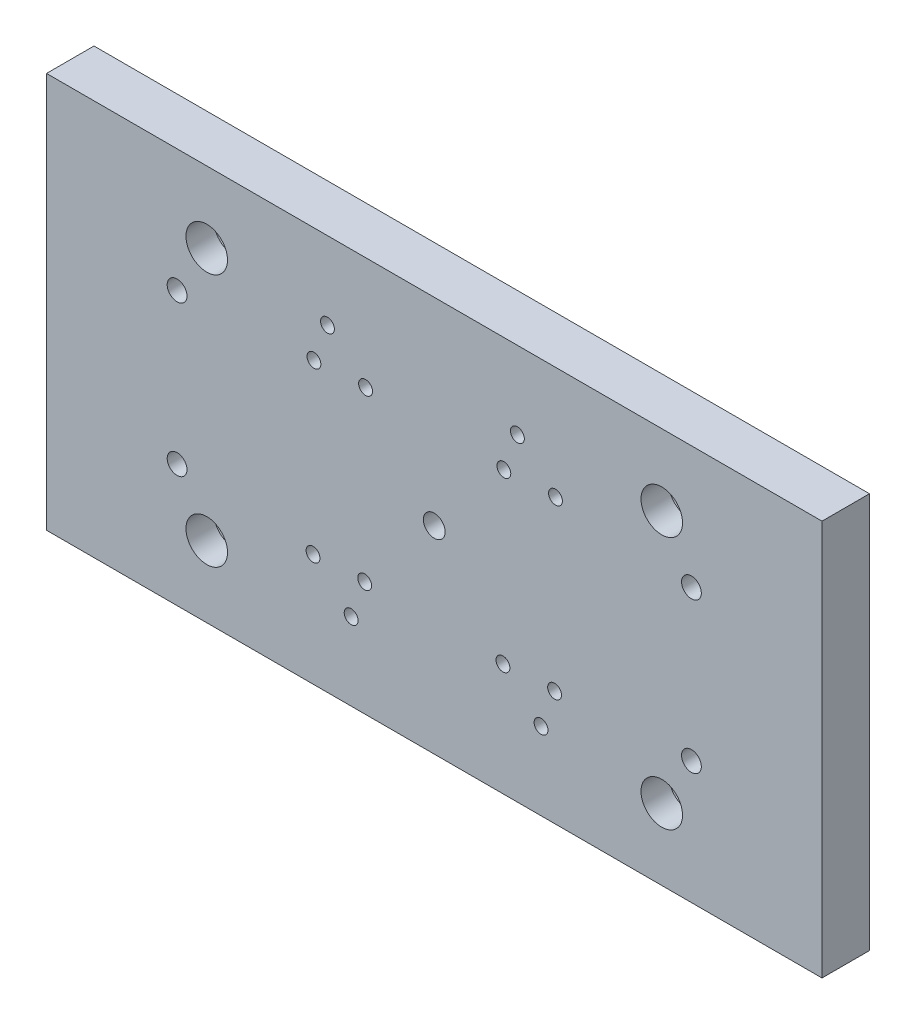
ISO-10303-21;
HEADER;
FILE_DESCRIPTION(('STEP AP214'),'2;1');
FILE_NAME('part.step','',(''),(''),'','','');
FILE_SCHEMA(('AUTOMOTIVE_DESIGN { 1 0 10303 214 1 1 1 1 }'));
ENDSEC;
DATA;
#1=APPLICATION_CONTEXT('core data for automotive mechanical design processes');
#2=APPLICATION_PROTOCOL_DEFINITION('international standard','automotive_design',2000,#1);
#3=PRODUCT_CONTEXT('',#1,'mechanical');
#4=PRODUCT('Part','Part','',(#3));
#5=PRODUCT_RELATED_PRODUCT_CATEGORY('part','',(#4));
#6=PRODUCT_DEFINITION_FORMATION('','',#4);
#7=PRODUCT_DEFINITION_CONTEXT('part definition',#1,'design');
#8=PRODUCT_DEFINITION('design','',#6,#7);
#9=PRODUCT_DEFINITION_SHAPE('','',#8);
#10=(LENGTH_UNIT() NAMED_UNIT(*) SI_UNIT(.MILLI.,.METRE.));
#11=(NAMED_UNIT(*) PLANE_ANGLE_UNIT() SI_UNIT($,.RADIAN.));
#12=(NAMED_UNIT(*) SI_UNIT($,.STERADIAN.) SOLID_ANGLE_UNIT());
#13=UNCERTAINTY_MEASURE_WITH_UNIT(LENGTH_MEASURE(1.E-05),#10,'distance_accuracy_value','');
#14=(GEOMETRIC_REPRESENTATION_CONTEXT(3) GLOBAL_UNCERTAINTY_ASSIGNED_CONTEXT((#13)) GLOBAL_UNIT_ASSIGNED_CONTEXT((#10,
#11,#12)) REPRESENTATION_CONTEXT('',''));
#15=CARTESIAN_POINT('',(0.,0.,0.));
#16=DIRECTION('',(0.,0.,1.));
#17=DIRECTION('',(1.,0.,0.));
#18=AXIS2_PLACEMENT_3D('',#15,#16,#17);
#19=CARTESIAN_POINT('',(40.5,18.,0.));
#20=DIRECTION('',(0.,0.,1.));
#21=DIRECTION('',(1.,0.,0.));
#22=AXIS2_PLACEMENT_3D('',#19,#20,#21);
#23=CYLINDRICAL_SURFACE('',#22,5.25000000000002);
#24=CARTESIAN_POINT('',(40.5,18.,12.));
#25=DIRECTION('',(0.,0.,1.));
#26=DIRECTION('',(1.,0.,0.));
#27=AXIS2_PLACEMENT_3D('',#24,#25,#26);
#28=CIRCLE('',#27,5.25000000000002);
#29=CARTESIAN_POINT('',(45.75,18.,12.));
#30=VERTEX_POINT('',#29);
#31=EDGE_CURVE('E636',#30,#30,#28,.T.);
#32=ORIENTED_EDGE('',*,*,#31,.T.);
#33=EDGE_LOOP('',(#32));
#34=FACE_BOUND('',#33,.T.);
#35=CARTESIAN_POINT('',(40.5,18.,5.));
#36=DIRECTION('',(0.,0.,-1.));
#37=DIRECTION('',(-1.,0.,0.));
#38=AXIS2_PLACEMENT_3D('',#35,#36,#37);
#39=CIRCLE('',#38,5.25000000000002);
#40=CARTESIAN_POINT('',(35.25,18.,5.));
#41=VERTEX_POINT('',#40);
#42=EDGE_CURVE('E520',#41,#41,#39,.F.);
#43=ORIENTED_EDGE('',*,*,#42,.F.);
#44=EDGE_LOOP('',(#43));
#45=FACE_BOUND('',#44,.T.);
#46=ADVANCED_FACE('F366',(#34,#45),#23,.F.);
#47=CARTESIAN_POINT('',(155.5,82.,0.));
#48=DIRECTION('',(0.,0.,1.));
#49=DIRECTION('',(1.,0.,0.));
#50=AXIS2_PLACEMENT_3D('',#47,#48,#49);
#51=CYLINDRICAL_SURFACE('',#50,5.25);
#52=CARTESIAN_POINT('',(155.5,82.,12.));
#53=DIRECTION('',(0.,0.,1.));
#54=DIRECTION('',(1.,0.,0.));
#55=AXIS2_PLACEMENT_3D('',#52,#53,#54);
#56=CIRCLE('',#55,5.25);
#57=CARTESIAN_POINT('',(160.75,82.,12.));
#58=VERTEX_POINT('',#57);
#59=EDGE_CURVE('E426',#58,#58,#56,.T.);
#60=ORIENTED_EDGE('',*,*,#59,.T.);
#61=EDGE_LOOP('',(#60));
#62=FACE_BOUND('',#61,.T.);
#63=CARTESIAN_POINT('',(155.5,82.,5.));
#64=DIRECTION('',(0.,0.,-1.));
#65=DIRECTION('',(-1.,0.,0.));
#66=AXIS2_PLACEMENT_3D('',#63,#64,#65);
#67=CIRCLE('',#66,5.25);
#68=CARTESIAN_POINT('',(150.25,82.,5.));
#69=VERTEX_POINT('',#68);
#70=EDGE_CURVE('E511',#69,#69,#67,.F.);
#71=ORIENTED_EDGE('',*,*,#70,.F.);
#72=EDGE_LOOP('',(#71));
#73=FACE_BOUND('',#72,.T.);
#74=ADVANCED_FACE('F661',(#62,#73),#51,.F.);
#75=CARTESIAN_POINT('',(115.59,71.07,0.));
#76=DIRECTION('',(0.,0.,1.));
#77=DIRECTION('',(1.,0.,0.));
#78=AXIS2_PLACEMENT_3D('',#75,#76,#77);
#79=CYLINDRICAL_SURFACE('',#78,1.75);
#80=CARTESIAN_POINT('',(115.59,71.07,12.));
#81=DIRECTION('',(0.,0.,1.));
#82=DIRECTION('',(1.,0.,0.));
#83=AXIS2_PLACEMENT_3D('',#80,#81,#82);
#84=CIRCLE('',#83,1.75);
#85=CARTESIAN_POINT('',(117.34,71.07,12.));
#86=VERTEX_POINT('',#85);
#87=EDGE_CURVE('E621',#86,#86,#84,.T.);
#88=ORIENTED_EDGE('',*,*,#87,.T.);
#89=EDGE_LOOP('',(#88));
#90=FACE_BOUND('',#89,.T.);
#91=CARTESIAN_POINT('',(115.59,71.07,3.05));
#92=DIRECTION('',(0.,0.,-1.));
#93=DIRECTION('',(-1.,0.,0.));
#94=AXIS2_PLACEMENT_3D('',#91,#92,#93);
#95=CIRCLE('',#94,1.75);
#96=CARTESIAN_POINT('',(113.84,71.07,3.05));
#97=VERTEX_POINT('',#96);
#98=EDGE_CURVE('E506',#97,#97,#95,.F.);
#99=ORIENTED_EDGE('',*,*,#98,.F.);
#100=EDGE_LOOP('',(#99));
#101=FACE_BOUND('',#100,.T.);
#102=ADVANCED_FACE('F668',(#90,#101),#79,.F.);
#103=CARTESIAN_POINT('',(119.01,80.41,0.));
#104=DIRECTION('',(0.,0.,1.));
#105=DIRECTION('',(1.,0.,0.));
#106=AXIS2_PLACEMENT_3D('',#103,#104,#105);
#107=CYLINDRICAL_SURFACE('',#106,1.75);
#108=CARTESIAN_POINT('',(119.01,80.41,12.));
#109=DIRECTION('',(0.,0.,1.));
#110=DIRECTION('',(1.,0.,0.));
#111=AXIS2_PLACEMENT_3D('',#108,#109,#110);
#112=CIRCLE('',#111,1.75);
#113=CARTESIAN_POINT('',(120.76,80.41,12.));
#114=VERTEX_POINT('',#113);
#115=EDGE_CURVE('E627',#114,#114,#112,.T.);
#116=ORIENTED_EDGE('',*,*,#115,.T.);
#117=EDGE_LOOP('',(#116));
#118=FACE_BOUND('',#117,.T.);
#119=CARTESIAN_POINT('',(119.01,80.41,3.05));
#120=DIRECTION('',(0.,0.,-1.));
#121=DIRECTION('',(-1.,0.,0.));
#122=AXIS2_PLACEMENT_3D('',#119,#120,#121);
#123=CIRCLE('',#122,1.75);
#124=CARTESIAN_POINT('',(117.26,80.41,3.05));
#125=VERTEX_POINT('',#124);
#126=EDGE_CURVE('E501',#125,#125,#123,.F.);
#127=ORIENTED_EDGE('',*,*,#126,.F.);
#128=EDGE_LOOP('',(#127));
#129=FACE_BOUND('',#128,.T.);
#130=ADVANCED_FACE('F794',(#118,#129),#107,.F.);
#131=CARTESIAN_POINT('',(128.64,71.58,0.));
#132=DIRECTION('',(0.,0.,1.));
#133=DIRECTION('',(1.,0.,0.));
#134=AXIS2_PLACEMENT_3D('',#131,#132,#133);
#135=CYLINDRICAL_SURFACE('',#134,1.75000000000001);
#136=CARTESIAN_POINT('',(128.64,71.58,12.));
#137=DIRECTION('',(0.,0.,1.));
#138=DIRECTION('',(1.,0.,0.));
#139=AXIS2_PLACEMENT_3D('',#136,#137,#138);
#140=CIRCLE('',#139,1.75000000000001);
#141=CARTESIAN_POINT('',(130.39,71.58,12.));
#142=VERTEX_POINT('',#141);
#143=EDGE_CURVE('E624',#142,#142,#140,.T.);
#144=ORIENTED_EDGE('',*,*,#143,.T.);
#145=EDGE_LOOP('',(#144));
#146=FACE_BOUND('',#145,.T.);
#147=CARTESIAN_POINT('',(128.64,71.58,3.05));
#148=DIRECTION('',(0.,0.,-1.));
#149=DIRECTION('',(-1.,0.,0.));
#150=AXIS2_PLACEMENT_3D('',#147,#148,#149);
#151=CIRCLE('',#150,1.75000000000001);
#152=CARTESIAN_POINT('',(126.89,71.58,3.05));
#153=VERTEX_POINT('',#152);
#154=EDGE_CURVE('E496',#153,#153,#151,.F.);
#155=ORIENTED_EDGE('',*,*,#154,.F.);
#156=EDGE_LOOP('',(#155));
#157=FACE_BOUND('',#156,.T.);
#158=ADVANCED_FACE('F791',(#146,#157),#135,.F.);
#159=CARTESIAN_POINT('',(80.64,71.58,0.));
#160=DIRECTION('',(0.,0.,1.));
#161=DIRECTION('',(1.,0.,0.));
#162=AXIS2_PLACEMENT_3D('',#159,#160,#161);
#163=CYLINDRICAL_SURFACE('',#162,1.75);
#164=CARTESIAN_POINT('',(80.64,71.58,12.));
#165=DIRECTION('',(0.,0.,1.));
#166=DIRECTION('',(1.,0.,0.));
#167=AXIS2_PLACEMENT_3D('',#164,#165,#166);
#168=CIRCLE('',#167,1.75);
#169=CARTESIAN_POINT('',(82.39,71.58,12.));
#170=VERTEX_POINT('',#169);
#171=EDGE_CURVE('E618',#170,#170,#168,.T.);
#172=ORIENTED_EDGE('',*,*,#171,.T.);
#173=EDGE_LOOP('',(#172));
#174=FACE_BOUND('',#173,.T.);
#175=CARTESIAN_POINT('',(80.64,71.58,3.05));
#176=DIRECTION('',(0.,0.,-1.));
#177=DIRECTION('',(-1.,0.,0.));
#178=AXIS2_PLACEMENT_3D('',#175,#176,#177);
#179=CIRCLE('',#178,1.75);
#180=CARTESIAN_POINT('',(78.89,71.58,3.05));
#181=VERTEX_POINT('',#180);
#182=EDGE_CURVE('E491',#181,#181,#179,.F.);
#183=ORIENTED_EDGE('',*,*,#182,.F.);
#184=EDGE_LOOP('',(#183));
#185=FACE_BOUND('',#184,.T.);
#186=ADVANCED_FACE('F787',(#174,#185),#163,.F.);
#187=CARTESIAN_POINT('',(71.01,80.41,0.));
#188=DIRECTION('',(0.,0.,1.));
#189=DIRECTION('',(1.,0.,0.));
#190=AXIS2_PLACEMENT_3D('',#187,#188,#189);
#191=CYLINDRICAL_SURFACE('',#190,1.75);
#192=CARTESIAN_POINT('',(71.01,80.41,12.));
#193=DIRECTION('',(0.,0.,1.));
#194=DIRECTION('',(1.,0.,0.));
#195=AXIS2_PLACEMENT_3D('',#192,#193,#194);
#196=CIRCLE('',#195,1.75);
#197=CARTESIAN_POINT('',(72.76,80.41,12.));
#198=VERTEX_POINT('',#197);
#199=EDGE_CURVE('E615',#198,#198,#196,.T.);
#200=ORIENTED_EDGE('',*,*,#199,.T.);
#201=EDGE_LOOP('',(#200));
#202=FACE_BOUND('',#201,.T.);
#203=CARTESIAN_POINT('',(71.01,80.41,3.05));
#204=DIRECTION('',(0.,0.,-1.));
#205=DIRECTION('',(-1.,0.,0.));
#206=AXIS2_PLACEMENT_3D('',#203,#204,#205);
#207=CIRCLE('',#206,1.75);
#208=CARTESIAN_POINT('',(69.26,80.41,3.05));
#209=VERTEX_POINT('',#208);
#210=EDGE_CURVE('E486',#209,#209,#207,.F.);
#211=ORIENTED_EDGE('',*,*,#210,.F.);
#212=EDGE_LOOP('',(#211));
#213=FACE_BOUND('',#212,.T.);
#214=ADVANCED_FACE('F783',(#202,#213),#191,.F.);
#215=CARTESIAN_POINT('',(67.59,71.01,0.));
#216=DIRECTION('',(0.,0.,1.));
#217=DIRECTION('',(1.,0.,0.));
#218=AXIS2_PLACEMENT_3D('',#215,#216,#217);
#219=CYLINDRICAL_SURFACE('',#218,1.75);
#220=CARTESIAN_POINT('',(67.59,71.01,12.));
#221=DIRECTION('',(0.,0.,1.));
#222=DIRECTION('',(1.,0.,0.));
#223=AXIS2_PLACEMENT_3D('',#220,#221,#222);
#224=CIRCLE('',#223,1.75);
#225=CARTESIAN_POINT('',(69.34,71.01,12.));
#226=VERTEX_POINT('',#225);
#227=EDGE_CURVE('E612',#226,#226,#224,.T.);
#228=ORIENTED_EDGE('',*,*,#227,.T.);
#229=EDGE_LOOP('',(#228));
#230=FACE_BOUND('',#229,.T.);
#231=CARTESIAN_POINT('',(67.59,71.01,3.05));
#232=DIRECTION('',(0.,0.,-1.));
#233=DIRECTION('',(-1.,0.,0.));
#234=AXIS2_PLACEMENT_3D('',#231,#232,#233);
#235=CIRCLE('',#234,1.75);
#236=CARTESIAN_POINT('',(65.84,71.01,3.05));
#237=VERTEX_POINT('',#236);
#238=EDGE_CURVE('E481',#237,#237,#235,.F.);
#239=ORIENTED_EDGE('',*,*,#238,.F.);
#240=EDGE_LOOP('',(#239));
#241=FACE_BOUND('',#240,.T.);
#242=ADVANCED_FACE('F776',(#230,#241),#219,.F.);
#243=CARTESIAN_POINT('',(67.36,28.42,0.));
#244=DIRECTION('',(0.,0.,1.));
#245=DIRECTION('',(1.,0.,0.));
#246=AXIS2_PLACEMENT_3D('',#243,#244,#245);
#247=CYLINDRICAL_SURFACE('',#246,1.75000000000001);
#248=CARTESIAN_POINT('',(67.36,28.42,12.));
#249=DIRECTION('',(0.,0.,1.));
#250=DIRECTION('',(1.,0.,0.));
#251=AXIS2_PLACEMENT_3D('',#248,#249,#250);
#252=CIRCLE('',#251,1.75000000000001);
#253=CARTESIAN_POINT('',(69.11,28.42,12.));
#254=VERTEX_POINT('',#253);
#255=EDGE_CURVE('E606',#254,#254,#252,.T.);
#256=ORIENTED_EDGE('',*,*,#255,.T.);
#257=EDGE_LOOP('',(#256));
#258=FACE_BOUND('',#257,.T.);
#259=CARTESIAN_POINT('',(67.36,28.42,3.05));
#260=DIRECTION('',(0.,0.,-1.));
#261=DIRECTION('',(-1.,0.,0.));
#262=AXIS2_PLACEMENT_3D('',#259,#260,#261);
#263=CIRCLE('',#262,1.75000000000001);
#264=CARTESIAN_POINT('',(65.61,28.42,3.05));
#265=VERTEX_POINT('',#264);
#266=EDGE_CURVE('E476',#265,#265,#263,.F.);
#267=ORIENTED_EDGE('',*,*,#266,.F.);
#268=EDGE_LOOP('',(#267));
#269=FACE_BOUND('',#268,.T.);
#270=ADVANCED_FACE('F773',(#258,#269),#247,.F.);
#271=CARTESIAN_POINT('',(76.99,19.59,0.));
#272=DIRECTION('',(0.,0.,1.));
#273=DIRECTION('',(1.,0.,0.));
#274=AXIS2_PLACEMENT_3D('',#271,#272,#273);
#275=CYLINDRICAL_SURFACE('',#274,1.75);
#276=CARTESIAN_POINT('',(76.99,19.59,12.));
#277=DIRECTION('',(0.,0.,1.));
#278=DIRECTION('',(1.,0.,0.));
#279=AXIS2_PLACEMENT_3D('',#276,#277,#278);
#280=CIRCLE('',#279,1.75);
#281=CARTESIAN_POINT('',(78.74,19.59,12.));
#282=VERTEX_POINT('',#281);
#283=EDGE_CURVE('E609',#282,#282,#280,.T.);
#284=ORIENTED_EDGE('',*,*,#283,.T.);
#285=EDGE_LOOP('',(#284));
#286=FACE_BOUND('',#285,.T.);
#287=CARTESIAN_POINT('',(76.99,19.59,3.05));
#288=DIRECTION('',(0.,0.,-1.));
#289=DIRECTION('',(-1.,0.,0.));
#290=AXIS2_PLACEMENT_3D('',#287,#288,#289);
#291=CIRCLE('',#290,1.75);
#292=CARTESIAN_POINT('',(75.24,19.59,3.05));
#293=VERTEX_POINT('',#292);
#294=EDGE_CURVE('E471',#293,#293,#291,.F.);
#295=ORIENTED_EDGE('',*,*,#294,.F.);
#296=EDGE_LOOP('',(#295));
#297=FACE_BOUND('',#296,.T.);
#298=ADVANCED_FACE('F771',(#286,#297),#275,.F.);
#299=CARTESIAN_POINT('',(80.41,28.93,0.));
#300=DIRECTION('',(0.,0.,1.));
#301=DIRECTION('',(1.,0.,0.));
#302=AXIS2_PLACEMENT_3D('',#299,#300,#301);
#303=CYLINDRICAL_SURFACE('',#302,1.75);
#304=CARTESIAN_POINT('',(80.41,28.93,12.));
#305=DIRECTION('',(0.,0.,1.));
#306=DIRECTION('',(1.,0.,0.));
#307=AXIS2_PLACEMENT_3D('',#304,#305,#306);
#308=CIRCLE('',#307,1.75);
#309=CARTESIAN_POINT('',(82.16,28.93,12.));
#310=VERTEX_POINT('',#309);
#311=EDGE_CURVE('E603',#310,#310,#308,.T.);
#312=ORIENTED_EDGE('',*,*,#311,.T.);
#313=EDGE_LOOP('',(#312));
#314=FACE_BOUND('',#313,.T.);
#315=CARTESIAN_POINT('',(80.41,28.93,3.05));
#316=DIRECTION('',(0.,0.,-1.));
#317=DIRECTION('',(-1.,0.,0.));
#318=AXIS2_PLACEMENT_3D('',#315,#316,#317);
#319=CIRCLE('',#318,1.75);
#320=CARTESIAN_POINT('',(78.66,28.93,3.05));
#321=VERTEX_POINT('',#320);
#322=EDGE_CURVE('E466',#321,#321,#319,.F.);
#323=ORIENTED_EDGE('',*,*,#322,.F.);
#324=EDGE_LOOP('',(#323));
#325=FACE_BOUND('',#324,.T.);
#326=ADVANCED_FACE('F759',(#314,#325),#303,.F.);
#327=CARTESIAN_POINT('',(115.36,28.42,0.));
#328=DIRECTION('',(0.,0.,1.));
#329=DIRECTION('',(1.,0.,0.));
#330=AXIS2_PLACEMENT_3D('',#327,#328,#329);
#331=CYLINDRICAL_SURFACE('',#330,1.75);
#332=CARTESIAN_POINT('',(115.36,28.42,12.));
#333=DIRECTION('',(0.,0.,1.));
#334=DIRECTION('',(1.,0.,0.));
#335=AXIS2_PLACEMENT_3D('',#332,#333,#334);
#336=CIRCLE('',#335,1.75);
#337=CARTESIAN_POINT('',(117.11,28.42,12.));
#338=VERTEX_POINT('',#337);
#339=EDGE_CURVE('E449',#338,#338,#336,.T.);
#340=ORIENTED_EDGE('',*,*,#339,.T.);
#341=EDGE_LOOP('',(#340));
#342=FACE_BOUND('',#341,.T.);
#343=CARTESIAN_POINT('',(115.36,28.42,3.05));
#344=DIRECTION('',(0.,0.,-1.));
#345=DIRECTION('',(-1.,0.,0.));
#346=AXIS2_PLACEMENT_3D('',#343,#344,#345);
#347=CIRCLE('',#346,1.75);
#348=CARTESIAN_POINT('',(113.61,28.42,3.05));
#349=VERTEX_POINT('',#348);
#350=EDGE_CURVE('E461',#349,#349,#347,.F.);
#351=ORIENTED_EDGE('',*,*,#350,.F.);
#352=EDGE_LOOP('',(#351));
#353=FACE_BOUND('',#352,.T.);
#354=ADVANCED_FACE('F755',(#342,#353),#331,.F.);
#355=CARTESIAN_POINT('',(128.41,28.99,0.));
#356=DIRECTION('',(0.,0.,1.));
#357=DIRECTION('',(1.,0.,0.));
#358=AXIS2_PLACEMENT_3D('',#355,#356,#357);
#359=CYLINDRICAL_SURFACE('',#358,1.75000000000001);
#360=CARTESIAN_POINT('',(128.41,28.99,12.));
#361=DIRECTION('',(0.,0.,1.));
#362=DIRECTION('',(1.,0.,0.));
#363=AXIS2_PLACEMENT_3D('',#360,#361,#362);
#364=CIRCLE('',#363,1.75000000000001);
#365=CARTESIAN_POINT('',(130.16,28.99,12.));
#366=VERTEX_POINT('',#365);
#367=EDGE_CURVE('E597',#366,#366,#364,.T.);
#368=ORIENTED_EDGE('',*,*,#367,.T.);
#369=EDGE_LOOP('',(#368));
#370=FACE_BOUND('',#369,.T.);
#371=CARTESIAN_POINT('',(128.41,28.99,3.05));
#372=DIRECTION('',(0.,0.,-1.));
#373=DIRECTION('',(-1.,0.,0.));
#374=AXIS2_PLACEMENT_3D('',#371,#372,#373);
#375=CIRCLE('',#374,1.75000000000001);
#376=CARTESIAN_POINT('',(126.66,28.99,3.05));
#377=VERTEX_POINT('',#376);
#378=EDGE_CURVE('E456',#377,#377,#375,.F.);
#379=ORIENTED_EDGE('',*,*,#378,.F.);
#380=EDGE_LOOP('',(#379));
#381=FACE_BOUND('',#380,.T.);
#382=ADVANCED_FACE('F758',(#370,#381),#359,.F.);
#383=CARTESIAN_POINT('',(124.99,19.59,0.));
#384=DIRECTION('',(0.,0.,1.));
#385=DIRECTION('',(1.,0.,0.));
#386=AXIS2_PLACEMENT_3D('',#383,#384,#385);
#387=CYLINDRICAL_SURFACE('',#386,1.75);
#388=CARTESIAN_POINT('',(124.99,19.59,12.));
#389=DIRECTION('',(0.,0.,1.));
#390=DIRECTION('',(1.,0.,0.));
#391=AXIS2_PLACEMENT_3D('',#388,#389,#390);
#392=CIRCLE('',#391,1.75);
#393=CARTESIAN_POINT('',(126.74,19.59,12.));
#394=VERTEX_POINT('',#393);
#395=EDGE_CURVE('E600',#394,#394,#392,.T.);
#396=ORIENTED_EDGE('',*,*,#395,.T.);
#397=EDGE_LOOP('',(#396));
#398=FACE_BOUND('',#397,.T.);
#399=CARTESIAN_POINT('',(124.99,19.59,3.05));
#400=DIRECTION('',(0.,0.,-1.));
#401=DIRECTION('',(-1.,0.,0.));
#402=AXIS2_PLACEMENT_3D('',#399,#400,#401);
#403=CIRCLE('',#402,1.75);
#404=CARTESIAN_POINT('',(123.24,19.59,3.05));
#405=VERTEX_POINT('',#404);
#406=EDGE_CURVE('E451',#405,#405,#403,.F.);
#407=ORIENTED_EDGE('',*,*,#406,.F.);
#408=EDGE_LOOP('',(#407));
#409=FACE_BOUND('',#408,.T.);
#410=ADVANCED_FACE('F763',(#398,#409),#387,.F.);
#411=CARTESIAN_POINT('',(98.,50.,0.));
#412=DIRECTION('',(0.,0.,1.));
#413=DIRECTION('',(1.,0.,0.));
#414=AXIS2_PLACEMENT_3D('',#411,#412,#413);
#415=CYLINDRICAL_SURFACE('',#414,2.75000000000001);
#416=CARTESIAN_POINT('',(98.,50.,12.));
#417=DIRECTION('',(0.,0.,1.));
#418=DIRECTION('',(1.,0.,0.));
#419=AXIS2_PLACEMENT_3D('',#416,#417,#418);
#420=CIRCLE('',#419,2.75000000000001);
#421=CARTESIAN_POINT('',(100.75,50.,12.));
#422=VERTEX_POINT('',#421);
#423=EDGE_CURVE('E630',#422,#422,#420,.T.);
#424=ORIENTED_EDGE('',*,*,#423,.T.);
#425=EDGE_LOOP('',(#424));
#426=FACE_BOUND('',#425,.T.);
#427=CARTESIAN_POINT('',(98.,50.,3.05));
#428=DIRECTION('',(0.,0.,-1.));
#429=DIRECTION('',(-1.,0.,0.));
#430=AXIS2_PLACEMENT_3D('',#427,#428,#429);
#431=CIRCLE('',#430,2.75000000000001);
#432=CARTESIAN_POINT('',(95.25,50.,3.05));
#433=VERTEX_POINT('',#432);
#434=EDGE_CURVE('E446',#433,#433,#431,.F.);
#435=ORIENTED_EDGE('',*,*,#434,.F.);
#436=EDGE_LOOP('',(#435));
#437=FACE_BOUND('',#436,.T.);
#438=ADVANCED_FACE('F767',(#426,#437),#415,.F.);
#439=CARTESIAN_POINT('',(0.,0.,12.));
#440=DIRECTION('',(1.,0.,0.));
#441=DIRECTION('',(0.,1.,0.));
#442=AXIS2_PLACEMENT_3D('',#439,#440,#441);
#443=PLANE('',#442);
#444=DIRECTION('',(0.,-1.,0.));
#445=VECTOR('',#444,1.);
#446=CARTESIAN_POINT('',(0.,0.,0.));
#447=LINE('',#446,#445);
#448=CARTESIAN_POINT('',(0.,100.,0.));
#449=VERTEX_POINT('',#448);
#450=CARTESIAN_POINT('',(0.,0.,0.));
#451=VERTEX_POINT('',#450);
#452=EDGE_CURVE('E413',#449,#451,#447,.T.);
#453=ORIENTED_EDGE('',*,*,#452,.T.);
#454=DIRECTION('',(0.,0.,-1.));
#455=VECTOR('',#454,1.);
#456=CARTESIAN_POINT('',(0.,0.,12.));
#457=LINE('',#456,#455);
#458=CARTESIAN_POINT('',(0.,0.,12.));
#459=VERTEX_POINT('',#458);
#460=EDGE_CURVE('E11',#459,#451,#457,.T.);
#461=ORIENTED_EDGE('',*,*,#460,.F.);
#462=DIRECTION('',(0.,-1.,0.));
#463=VECTOR('',#462,1.);
#464=CARTESIAN_POINT('',(0.,0.,12.));
#465=LINE('',#464,#463);
#466=CARTESIAN_POINT('',(0.,100.,12.));
#467=VERTEX_POINT('',#466);
#468=EDGE_CURVE('E436',#467,#459,#465,.T.);
#469=ORIENTED_EDGE('',*,*,#468,.F.);
#470=DIRECTION('',(0.,0.,-1.));
#471=VECTOR('',#470,1.);
#472=CARTESIAN_POINT('',(0.,100.,12.));
#473=LINE('',#472,#471);
#474=EDGE_CURVE('E425',#467,#449,#473,.T.);
#475=ORIENTED_EDGE('',*,*,#474,.T.);
#476=EDGE_LOOP('',(#453,#461,#469,#475));
#477=FACE_BOUND('',#476,.T.);
#478=ADVANCED_FACE('F368',(#477),#443,.F.);
#479=CARTESIAN_POINT('',(0.,0.,12.));
#480=DIRECTION('',(0.,1.,0.));
#481=DIRECTION('',(0.,0.,1.));
#482=AXIS2_PLACEMENT_3D('',#479,#480,#481);
#483=PLANE('',#482);
#484=DIRECTION('',(1.,0.,0.));
#485=VECTOR('',#484,1.);
#486=CARTESIAN_POINT('',(0.,0.,0.));
#487=LINE('',#486,#485);
#488=CARTESIAN_POINT('',(196.,0.,0.));
#489=VERTEX_POINT('',#488);
#490=EDGE_CURVE('E409',#451,#489,#487,.T.);
#491=ORIENTED_EDGE('',*,*,#490,.T.);
#492=DIRECTION('',(0.,0.,-1.));
#493=VECTOR('',#492,1.);
#494=CARTESIAN_POINT('',(196.,0.,12.));
#495=LINE('',#494,#493);
#496=CARTESIAN_POINT('',(196.,0.,12.));
#497=VERTEX_POINT('',#496);
#498=EDGE_CURVE('E375',#497,#489,#495,.T.);
#499=ORIENTED_EDGE('',*,*,#498,.F.);
#500=DIRECTION('',(1.,0.,0.));
#501=VECTOR('',#500,1.);
#502=CARTESIAN_POINT('',(0.,0.,12.));
#503=LINE('',#502,#501);
#504=EDGE_CURVE('E421',#459,#497,#503,.T.);
#505=ORIENTED_EDGE('',*,*,#504,.F.);
#506=ORIENTED_EDGE('',*,*,#460,.T.);
#507=EDGE_LOOP('',(#491,#499,#505,#506));
#508=FACE_BOUND('',#507,.T.);
#509=ADVANCED_FACE('F420',(#508),#483,.F.);
#510=CARTESIAN_POINT('',(196.,0.,12.));
#511=DIRECTION('',(-1.,0.,0.));
#512=DIRECTION('',(0.,-1.,0.));
#513=AXIS2_PLACEMENT_3D('',#510,#511,#512);
#514=PLANE('',#513);
#515=DIRECTION('',(0.,1.,0.));
#516=VECTOR('',#515,1.);
#517=CARTESIAN_POINT('',(196.,0.,0.));
#518=LINE('',#517,#516);
#519=CARTESIAN_POINT('',(196.,100.,0.));
#520=VERTEX_POINT('',#519);
#521=EDGE_CURVE('E414',#489,#520,#518,.T.);
#522=ORIENTED_EDGE('',*,*,#521,.T.);
#523=DIRECTION('',(0.,0.,-1.));
#524=VECTOR('',#523,1.);
#525=CARTESIAN_POINT('',(196.,100.,12.));
#526=LINE('',#525,#524);
#527=CARTESIAN_POINT('',(196.,100.,12.));
#528=VERTEX_POINT('',#527);
#529=EDGE_CURVE('E442',#528,#520,#526,.T.);
#530=ORIENTED_EDGE('',*,*,#529,.F.);
#531=DIRECTION('',(0.,1.,0.));
#532=VECTOR('',#531,1.);
#533=CARTESIAN_POINT('',(196.,0.,12.));
#534=LINE('',#533,#532);
#535=EDGE_CURVE('E388',#497,#528,#534,.T.);
#536=ORIENTED_EDGE('',*,*,#535,.F.);
#537=ORIENTED_EDGE('',*,*,#498,.T.);
#538=EDGE_LOOP('',(#522,#530,#536,#537));
#539=FACE_BOUND('',#538,.T.);
#540=ADVANCED_FACE('F651',(#539),#514,.F.);
#541=CARTESIAN_POINT('',(0.,100.,12.));
#542=DIRECTION('',(0.,-1.,0.));
#543=DIRECTION('',(0.,0.,-1.));
#544=AXIS2_PLACEMENT_3D('',#541,#542,#543);
#545=PLANE('',#544);
#546=DIRECTION('',(-1.,0.,0.));
#547=VECTOR('',#546,1.);
#548=CARTESIAN_POINT('',(0.,100.,0.));
#549=LINE('',#548,#547);
#550=EDGE_CURVE('E434',#520,#449,#549,.T.);
#551=ORIENTED_EDGE('',*,*,#550,.T.);
#552=ORIENTED_EDGE('',*,*,#474,.F.);
#553=DIRECTION('',(-1.,0.,0.));
#554=VECTOR('',#553,1.);
#555=CARTESIAN_POINT('',(0.,100.,12.));
#556=LINE('',#555,#554);
#557=EDGE_CURVE('E383',#528,#467,#556,.T.);
#558=ORIENTED_EDGE('',*,*,#557,.F.);
#559=ORIENTED_EDGE('',*,*,#529,.T.);
#560=EDGE_LOOP('',(#551,#552,#558,#559));
#561=FACE_BOUND('',#560,.T.);
#562=ADVANCED_FACE('F646',(#561),#545,.F.);
#563=CARTESIAN_POINT('',(0.,100.,12.));
#564=DIRECTION('',(0.,0.,-1.));
#565=DIRECTION('',(-1.,0.,0.));
#566=AXIS2_PLACEMENT_3D('',#563,#564,#565);
#567=PLANE('',#566);
#568=CARTESIAN_POINT('',(33.,69.,12.));
#569=DIRECTION('',(0.,0.,-1.));
#570=DIRECTION('',(-1.,0.,0.));
#571=AXIS2_PLACEMENT_3D('',#568,#569,#570);
#572=CIRCLE('',#571,2.5);
#573=CARTESIAN_POINT('',(30.5,69.,12.));
#574=VERTEX_POINT('',#573);
#575=EDGE_CURVE('E842',#574,#574,#572,.T.);
#576=ORIENTED_EDGE('',*,*,#575,.T.);
#577=EDGE_LOOP('',(#576));
#578=FACE_BOUND('',#577,.T.);
#579=CARTESIAN_POINT('',(163.,69.,12.));
#580=DIRECTION('',(0.,0.,-1.));
#581=DIRECTION('',(-1.,0.,0.));
#582=AXIS2_PLACEMENT_3D('',#579,#580,#581);
#583=CIRCLE('',#582,2.5);
#584=CARTESIAN_POINT('',(160.5,69.,12.));
#585=VERTEX_POINT('',#584);
#586=EDGE_CURVE('E838',#585,#585,#583,.T.);
#587=ORIENTED_EDGE('',*,*,#586,.T.);
#588=EDGE_LOOP('',(#587));
#589=FACE_BOUND('',#588,.T.);
#590=CARTESIAN_POINT('',(163.,31.,12.));
#591=DIRECTION('',(0.,0.,-1.));
#592=DIRECTION('',(-1.,0.,0.));
#593=AXIS2_PLACEMENT_3D('',#590,#591,#592);
#594=CIRCLE('',#593,2.5);
#595=CARTESIAN_POINT('',(160.5,31.,12.));
#596=VERTEX_POINT('',#595);
#597=EDGE_CURVE('E834',#596,#596,#594,.T.);
#598=ORIENTED_EDGE('',*,*,#597,.T.);
#599=EDGE_LOOP('',(#598));
#600=FACE_BOUND('',#599,.T.);
#601=CARTESIAN_POINT('',(33.,31.,12.));
#602=DIRECTION('',(0.,0.,-1.));
#603=DIRECTION('',(-1.,0.,0.));
#604=AXIS2_PLACEMENT_3D('',#601,#602,#603);
#605=CIRCLE('',#604,2.5);
#606=CARTESIAN_POINT('',(30.5,31.,12.));
#607=VERTEX_POINT('',#606);
#608=EDGE_CURVE('E830',#607,#607,#605,.T.);
#609=ORIENTED_EDGE('',*,*,#608,.T.);
#610=EDGE_LOOP('',(#609));
#611=FACE_BOUND('',#610,.T.);
#612=ORIENTED_EDGE('',*,*,#339,.F.);
#613=EDGE_LOOP('',(#612));
#614=FACE_BOUND('',#613,.T.);
#615=ORIENTED_EDGE('',*,*,#367,.F.);
#616=EDGE_LOOP('',(#615));
#617=FACE_BOUND('',#616,.T.);
#618=ORIENTED_EDGE('',*,*,#395,.F.);
#619=EDGE_LOOP('',(#618));
#620=FACE_BOUND('',#619,.T.);
#621=ORIENTED_EDGE('',*,*,#311,.F.);
#622=EDGE_LOOP('',(#621));
#623=FACE_BOUND('',#622,.T.);
#624=ORIENTED_EDGE('',*,*,#255,.F.);
#625=EDGE_LOOP('',(#624));
#626=FACE_BOUND('',#625,.T.);
#627=ORIENTED_EDGE('',*,*,#283,.F.);
#628=EDGE_LOOP('',(#627));
#629=FACE_BOUND('',#628,.T.);
#630=ORIENTED_EDGE('',*,*,#227,.F.);
#631=EDGE_LOOP('',(#630));
#632=FACE_BOUND('',#631,.T.);
#633=ORIENTED_EDGE('',*,*,#199,.F.);
#634=EDGE_LOOP('',(#633));
#635=FACE_BOUND('',#634,.T.);
#636=ORIENTED_EDGE('',*,*,#171,.F.);
#637=EDGE_LOOP('',(#636));
#638=FACE_BOUND('',#637,.T.);
#639=ORIENTED_EDGE('',*,*,#87,.F.);
#640=EDGE_LOOP('',(#639));
#641=FACE_BOUND('',#640,.T.);
#642=ORIENTED_EDGE('',*,*,#143,.F.);
#643=EDGE_LOOP('',(#642));
#644=FACE_BOUND('',#643,.T.);
#645=ORIENTED_EDGE('',*,*,#115,.F.);
#646=EDGE_LOOP('',(#645));
#647=FACE_BOUND('',#646,.T.);
#648=ORIENTED_EDGE('',*,*,#423,.F.);
#649=EDGE_LOOP('',(#648));
#650=FACE_BOUND('',#649,.T.);
#651=CARTESIAN_POINT('',(155.5,18.,12.));
#652=DIRECTION('',(0.,0.,1.));
#653=DIRECTION('',(-1.,0.,0.));
#654=AXIS2_PLACEMENT_3D('',#651,#652,#653);
#655=CIRCLE('',#654,5.25);
#656=CARTESIAN_POINT('',(150.25,18.,12.));
#657=VERTEX_POINT('',#656);
#658=EDGE_CURVE('E633',#657,#657,#655,.T.);
#659=ORIENTED_EDGE('',*,*,#658,.F.);
#660=EDGE_LOOP('',(#659));
#661=FACE_BOUND('',#660,.T.);
#662=ORIENTED_EDGE('',*,*,#31,.F.);
#663=EDGE_LOOP('',(#662));
#664=FACE_BOUND('',#663,.T.);
#665=CARTESIAN_POINT('',(40.5,82.,12.));
#666=DIRECTION('',(0.,0.,1.));
#667=DIRECTION('',(-1.,0.,0.));
#668=AXIS2_PLACEMENT_3D('',#665,#666,#667);
#669=CIRCLE('',#668,5.25000000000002);
#670=CARTESIAN_POINT('',(35.25,82.,12.));
#671=VERTEX_POINT('',#670);
#672=EDGE_CURVE('E429',#671,#671,#669,.T.);
#673=ORIENTED_EDGE('',*,*,#672,.F.);
#674=EDGE_LOOP('',(#673));
#675=FACE_BOUND('',#674,.T.);
#676=ORIENTED_EDGE('',*,*,#59,.F.);
#677=EDGE_LOOP('',(#676));
#678=FACE_BOUND('',#677,.T.);
#679=ORIENTED_EDGE('',*,*,#468,.T.);
#680=ORIENTED_EDGE('',*,*,#504,.T.);
#681=ORIENTED_EDGE('',*,*,#535,.T.);
#682=ORIENTED_EDGE('',*,*,#557,.T.);
#683=EDGE_LOOP('',(#679,#680,#681,#682));
#684=FACE_BOUND('',#683,.T.);
#685=ADVANCED_FACE('F643',(#578,#589,#600,#611,#614,#617,#620,#623,#626,#629,#632,#635,#638,
#641,#644,#647,#650,#661,#664,#675,#678,#684),#567,.F.);
#686=CARTESIAN_POINT('',(0.,100.,0.));
#687=DIRECTION('',(0.,0.,-1.));
#688=DIRECTION('',(-1.,0.,0.));
#689=AXIS2_PLACEMENT_3D('',#686,#687,#688);
#690=PLANE('',#689);
#691=CARTESIAN_POINT('',(33.,69.,0.));
#692=DIRECTION('',(0.,0.,-1.));
#693=DIRECTION('',(-1.,0.,0.));
#694=AXIS2_PLACEMENT_3D('',#691,#692,#693);
#695=CIRCLE('',#694,2.49999999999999);
#696=CARTESIAN_POINT('',(30.5,69.,0.));
#697=VERTEX_POINT('',#696);
#698=EDGE_CURVE('E687',#697,#697,#695,.T.);
#699=ORIENTED_EDGE('',*,*,#698,.F.);
#700=EDGE_LOOP('',(#699));
#701=FACE_BOUND('',#700,.T.);
#702=CARTESIAN_POINT('',(163.,69.,0.));
#703=DIRECTION('',(0.,0.,-1.));
#704=DIRECTION('',(-1.,0.,0.));
#705=AXIS2_PLACEMENT_3D('',#702,#703,#704);
#706=CIRCLE('',#705,2.5);
#707=CARTESIAN_POINT('',(160.5,69.,0.));
#708=VERTEX_POINT('',#707);
#709=EDGE_CURVE('E691',#708,#708,#706,.T.);
#710=ORIENTED_EDGE('',*,*,#709,.F.);
#711=EDGE_LOOP('',(#710));
#712=FACE_BOUND('',#711,.T.);
#713=CARTESIAN_POINT('',(163.,31.,0.));
#714=DIRECTION('',(0.,0.,-1.));
#715=DIRECTION('',(-1.,0.,0.));
#716=AXIS2_PLACEMENT_3D('',#713,#714,#715);
#717=CIRCLE('',#716,2.5);
#718=CARTESIAN_POINT('',(160.5,31.,0.));
#719=VERTEX_POINT('',#718);
#720=EDGE_CURVE('E695',#719,#719,#717,.T.);
#721=ORIENTED_EDGE('',*,*,#720,.F.);
#722=EDGE_LOOP('',(#721));
#723=FACE_BOUND('',#722,.T.);
#724=CARTESIAN_POINT('',(33.,31.,0.));
#725=DIRECTION('',(0.,0.,-1.));
#726=DIRECTION('',(-1.,0.,0.));
#727=AXIS2_PLACEMENT_3D('',#724,#725,#726);
#728=CIRCLE('',#727,2.49999999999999);
#729=CARTESIAN_POINT('',(30.5,31.,0.));
#730=VERTEX_POINT('',#729);
#731=EDGE_CURVE('E699',#730,#730,#728,.T.);
#732=ORIENTED_EDGE('',*,*,#731,.F.);
#733=EDGE_LOOP('',(#732));
#734=FACE_BOUND('',#733,.T.);
#735=CARTESIAN_POINT('',(155.5,18.,0.));
#736=DIRECTION('',(0.,0.,-1.));
#737=DIRECTION('',(1.,0.,0.));
#738=AXIS2_PLACEMENT_3D('',#735,#736,#737);
#739=CIRCLE('',#738,8.50000000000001);
#740=CARTESIAN_POINT('',(164.,18.,0.));
#741=VERTEX_POINT('',#740);
#742=EDGE_CURVE('E703',#741,#741,#739,.T.);
#743=ORIENTED_EDGE('',*,*,#742,.F.);
#744=EDGE_LOOP('',(#743));
#745=FACE_BOUND('',#744,.T.);
#746=CARTESIAN_POINT('',(40.5,18.,0.));
#747=DIRECTION('',(0.,0.,-1.));
#748=DIRECTION('',(-1.,0.,0.));
#749=AXIS2_PLACEMENT_3D('',#746,#747,#748);
#750=CIRCLE('',#749,8.50000000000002);
#751=CARTESIAN_POINT('',(32.,18.,0.));
#752=VERTEX_POINT('',#751);
#753=EDGE_CURVE('E529',#752,#752,#750,.T.);
#754=ORIENTED_EDGE('',*,*,#753,.F.);
#755=EDGE_LOOP('',(#754));
#756=FACE_BOUND('',#755,.T.);
#757=CARTESIAN_POINT('',(40.5,82.,0.));
#758=DIRECTION('',(0.,0.,-1.));
#759=DIRECTION('',(1.,0.,0.));
#760=AXIS2_PLACEMENT_3D('',#757,#758,#759);
#761=CIRCLE('',#760,8.50000000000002);
#762=CARTESIAN_POINT('',(49.,82.,0.));
#763=VERTEX_POINT('',#762);
#764=EDGE_CURVE('E522',#763,#763,#761,.T.);
#765=ORIENTED_EDGE('',*,*,#764,.F.);
#766=EDGE_LOOP('',(#765));
#767=FACE_BOUND('',#766,.T.);
#768=CARTESIAN_POINT('',(155.5,82.,0.));
#769=DIRECTION('',(0.,0.,-1.));
#770=DIRECTION('',(-1.,0.,0.));
#771=AXIS2_PLACEMENT_3D('',#768,#769,#770);
#772=CIRCLE('',#771,8.50000000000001);
#773=CARTESIAN_POINT('',(147.,82.,0.));
#774=VERTEX_POINT('',#773);
#775=EDGE_CURVE('E518',#774,#774,#772,.T.);
#776=ORIENTED_EDGE('',*,*,#775,.F.);
#777=EDGE_LOOP('',(#776));
#778=FACE_BOUND('',#777,.T.);
#779=CARTESIAN_POINT('',(115.59,71.07,0.));
#780=DIRECTION('',(0.,0.,-1.));
#781=DIRECTION('',(-1.,0.,0.));
#782=AXIS2_PLACEMENT_3D('',#779,#780,#781);
#783=CIRCLE('',#782,3.50000000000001);
#784=CARTESIAN_POINT('',(112.09,71.07,0.));
#785=VERTEX_POINT('',#784);
#786=EDGE_CURVE('E514',#785,#785,#783,.T.);
#787=ORIENTED_EDGE('',*,*,#786,.F.);
#788=EDGE_LOOP('',(#787));
#789=FACE_BOUND('',#788,.T.);
#790=CARTESIAN_POINT('',(119.01,80.41,0.));
#791=DIRECTION('',(0.,0.,-1.));
#792=DIRECTION('',(-1.,0.,0.));
#793=AXIS2_PLACEMENT_3D('',#790,#791,#792);
#794=CIRCLE('',#793,3.50000000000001);
#795=CARTESIAN_POINT('',(115.51,80.41,0.));
#796=VERTEX_POINT('',#795);
#797=EDGE_CURVE('E509',#796,#796,#794,.T.);
#798=ORIENTED_EDGE('',*,*,#797,.F.);
#799=EDGE_LOOP('',(#798));
#800=FACE_BOUND('',#799,.T.);
#801=CARTESIAN_POINT('',(128.64,71.58,0.));
#802=DIRECTION('',(0.,0.,-1.));
#803=DIRECTION('',(-1.,0.,0.));
#804=AXIS2_PLACEMENT_3D('',#801,#802,#803);
#805=CIRCLE('',#804,3.49999999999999);
#806=CARTESIAN_POINT('',(125.14,71.58,0.));
#807=VERTEX_POINT('',#806);
#808=EDGE_CURVE('E504',#807,#807,#805,.T.);
#809=ORIENTED_EDGE('',*,*,#808,.F.);
#810=EDGE_LOOP('',(#809));
#811=FACE_BOUND('',#810,.T.);
#812=CARTESIAN_POINT('',(80.64,71.58,0.));
#813=DIRECTION('',(0.,0.,-1.));
#814=DIRECTION('',(-1.,0.,0.));
#815=AXIS2_PLACEMENT_3D('',#812,#813,#814);
#816=CIRCLE('',#815,3.50000000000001);
#817=CARTESIAN_POINT('',(77.14,71.58,0.));
#818=VERTEX_POINT('',#817);
#819=EDGE_CURVE('E499',#818,#818,#816,.T.);
#820=ORIENTED_EDGE('',*,*,#819,.F.);
#821=EDGE_LOOP('',(#820));
#822=FACE_BOUND('',#821,.T.);
#823=CARTESIAN_POINT('',(71.01,80.41,0.));
#824=DIRECTION('',(0.,0.,-1.));
#825=DIRECTION('',(-1.,0.,0.));
#826=AXIS2_PLACEMENT_3D('',#823,#824,#825);
#827=CIRCLE('',#826,3.50000000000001);
#828=CARTESIAN_POINT('',(67.51,80.41,0.));
#829=VERTEX_POINT('',#828);
#830=EDGE_CURVE('E494',#829,#829,#827,.T.);
#831=ORIENTED_EDGE('',*,*,#830,.F.);
#832=EDGE_LOOP('',(#831));
#833=FACE_BOUND('',#832,.T.);
#834=CARTESIAN_POINT('',(67.59,71.01,0.));
#835=DIRECTION('',(0.,0.,-1.));
#836=DIRECTION('',(-1.,0.,0.));
#837=AXIS2_PLACEMENT_3D('',#834,#835,#836);
#838=CIRCLE('',#837,3.50000000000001);
#839=CARTESIAN_POINT('',(64.09,71.01,0.));
#840=VERTEX_POINT('',#839);
#841=EDGE_CURVE('E489',#840,#840,#838,.T.);
#842=ORIENTED_EDGE('',*,*,#841,.F.);
#843=EDGE_LOOP('',(#842));
#844=FACE_BOUND('',#843,.T.);
#845=CARTESIAN_POINT('',(67.36,28.42,0.));
#846=DIRECTION('',(0.,0.,-1.));
#847=DIRECTION('',(-1.,0.,0.));
#848=AXIS2_PLACEMENT_3D('',#845,#846,#847);
#849=CIRCLE('',#848,3.50000000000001);
#850=CARTESIAN_POINT('',(63.86,28.42,0.));
#851=VERTEX_POINT('',#850);
#852=EDGE_CURVE('E484',#851,#851,#849,.T.);
#853=ORIENTED_EDGE('',*,*,#852,.F.);
#854=EDGE_LOOP('',(#853));
#855=FACE_BOUND('',#854,.T.);
#856=CARTESIAN_POINT('',(76.99,19.59,0.));
#857=DIRECTION('',(0.,0.,-1.));
#858=DIRECTION('',(-1.,0.,0.));
#859=AXIS2_PLACEMENT_3D('',#856,#857,#858);
#860=CIRCLE('',#859,3.50000000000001);
#861=CARTESIAN_POINT('',(73.49,19.59,0.));
#862=VERTEX_POINT('',#861);
#863=EDGE_CURVE('E479',#862,#862,#860,.T.);
#864=ORIENTED_EDGE('',*,*,#863,.F.);
#865=EDGE_LOOP('',(#864));
#866=FACE_BOUND('',#865,.T.);
#867=CARTESIAN_POINT('',(80.41,28.93,0.));
#868=DIRECTION('',(0.,0.,-1.));
#869=DIRECTION('',(-1.,0.,0.));
#870=AXIS2_PLACEMENT_3D('',#867,#868,#869);
#871=CIRCLE('',#870,3.50000000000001);
#872=CARTESIAN_POINT('',(76.91,28.93,0.));
#873=VERTEX_POINT('',#872);
#874=EDGE_CURVE('E474',#873,#873,#871,.T.);
#875=ORIENTED_EDGE('',*,*,#874,.F.);
#876=EDGE_LOOP('',(#875));
#877=FACE_BOUND('',#876,.T.);
#878=CARTESIAN_POINT('',(115.36,28.42,0.));
#879=DIRECTION('',(0.,0.,-1.));
#880=DIRECTION('',(-1.,0.,0.));
#881=AXIS2_PLACEMENT_3D('',#878,#879,#880);
#882=CIRCLE('',#881,3.50000000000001);
#883=CARTESIAN_POINT('',(111.86,28.42,0.));
#884=VERTEX_POINT('',#883);
#885=EDGE_CURVE('E469',#884,#884,#882,.T.);
#886=ORIENTED_EDGE('',*,*,#885,.F.);
#887=EDGE_LOOP('',(#886));
#888=FACE_BOUND('',#887,.T.);
#889=CARTESIAN_POINT('',(128.41,28.99,0.));
#890=DIRECTION('',(0.,0.,-1.));
#891=DIRECTION('',(-1.,0.,0.));
#892=AXIS2_PLACEMENT_3D('',#889,#890,#891);
#893=CIRCLE('',#892,3.49999999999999);
#894=CARTESIAN_POINT('',(124.91,28.99,0.));
#895=VERTEX_POINT('',#894);
#896=EDGE_CURVE('E464',#895,#895,#893,.T.);
#897=ORIENTED_EDGE('',*,*,#896,.F.);
#898=EDGE_LOOP('',(#897));
#899=FACE_BOUND('',#898,.T.);
#900=CARTESIAN_POINT('',(124.99,19.59,0.));
#901=DIRECTION('',(0.,0.,-1.));
#902=DIRECTION('',(-1.,0.,0.));
#903=AXIS2_PLACEMENT_3D('',#900,#901,#902);
#904=CIRCLE('',#903,3.50000000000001);
#905=CARTESIAN_POINT('',(121.49,19.59,0.));
#906=VERTEX_POINT('',#905);
#907=EDGE_CURVE('E459',#906,#906,#904,.T.);
#908=ORIENTED_EDGE('',*,*,#907,.F.);
#909=EDGE_LOOP('',(#908));
#910=FACE_BOUND('',#909,.T.);
#911=CARTESIAN_POINT('',(98.,50.,0.));
#912=DIRECTION('',(0.,0.,-1.));
#913=DIRECTION('',(-1.,0.,0.));
#914=AXIS2_PLACEMENT_3D('',#911,#912,#913);
#915=CIRCLE('',#914,5.5);
#916=CARTESIAN_POINT('',(92.5,50.,0.));
#917=VERTEX_POINT('',#916);
#918=EDGE_CURVE('E454',#917,#917,#915,.T.);
#919=ORIENTED_EDGE('',*,*,#918,.F.);
#920=EDGE_LOOP('',(#919));
#921=FACE_BOUND('',#920,.T.);
#922=ORIENTED_EDGE('',*,*,#452,.F.);
#923=ORIENTED_EDGE('',*,*,#550,.F.);
#924=ORIENTED_EDGE('',*,*,#521,.F.);
#925=ORIENTED_EDGE('',*,*,#490,.F.);
#926=EDGE_LOOP('',(#922,#923,#924,#925));
#927=FACE_BOUND('',#926,.T.);
#928=ADVANCED_FACE('F410',(#701,#712,#723,#734,#745,#756,#767,#778,#789,#800,#811,#822,#833,
#844,#855,#866,#877,#888,#899,#910,#921,#927),#690,.T.);
#929=CARTESIAN_POINT('',(40.5,82.,0.));
#930=DIRECTION('',(0.,0.,1.));
#931=DIRECTION('',(1.,0.,0.));
#932=AXIS2_PLACEMENT_3D('',#929,#930,#931);
#933=CYLINDRICAL_SURFACE('',#932,5.25000000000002);
#934=CARTESIAN_POINT('',(40.5,82.,5.));
#935=DIRECTION('',(0.,0.,1.));
#936=DIRECTION('',(1.,0.,0.));
#937=AXIS2_PLACEMENT_3D('',#934,#935,#936);
#938=CIRCLE('',#937,5.25000000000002);
#939=CARTESIAN_POINT('',(45.75,82.,5.));
#940=VERTEX_POINT('',#939);
#941=EDGE_CURVE('E516',#940,#940,#938,.F.);
#942=ORIENTED_EDGE('',*,*,#941,.T.);
#943=EDGE_LOOP('',(#942));
#944=FACE_BOUND('',#943,.T.);
#945=ORIENTED_EDGE('',*,*,#672,.T.);
#946=EDGE_LOOP('',(#945));
#947=FACE_BOUND('',#946,.T.);
#948=ADVANCED_FACE('F641',(#944,#947),#933,.F.);
#949=CARTESIAN_POINT('',(155.5,18.,0.));
#950=DIRECTION('',(0.,0.,1.));
#951=DIRECTION('',(1.,0.,0.));
#952=AXIS2_PLACEMENT_3D('',#949,#950,#951);
#953=CYLINDRICAL_SURFACE('',#952,5.25);
#954=CARTESIAN_POINT('',(155.5,18.,5.));
#955=DIRECTION('',(0.,0.,1.));
#956=DIRECTION('',(1.,0.,0.));
#957=AXIS2_PLACEMENT_3D('',#954,#955,#956);
#958=CIRCLE('',#957,5.25);
#959=CARTESIAN_POINT('',(160.75,18.,5.));
#960=VERTEX_POINT('',#959);
#961=EDGE_CURVE('E370',#960,#960,#958,.F.);
#962=ORIENTED_EDGE('',*,*,#961,.T.);
#963=EDGE_LOOP('',(#962));
#964=FACE_BOUND('',#963,.T.);
#965=ORIENTED_EDGE('',*,*,#658,.T.);
#966=EDGE_LOOP('',(#965));
#967=FACE_BOUND('',#966,.T.);
#968=ADVANCED_FACE('F674',(#964,#967),#953,.F.);
#969=CARTESIAN_POINT('',(98.,50.,3.05));
#970=DIRECTION('',(0.,0.,-1.));
#971=DIRECTION('',(-1.,0.,0.));
#972=AXIS2_PLACEMENT_3D('',#969,#970,#971);
#973=PLANE('',#972);
#974=CARTESIAN_POINT('',(98.,50.,3.05));
#975=DIRECTION('',(0.,0.,-1.));
#976=DIRECTION('',(-1.,0.,0.));
#977=AXIS2_PLACEMENT_3D('',#974,#975,#976);
#978=CIRCLE('',#977,5.5);
#979=CARTESIAN_POINT('',(92.5,50.,3.05));
#980=VERTEX_POINT('',#979);
#981=EDGE_CURVE('E450',#980,#980,#978,.T.);
#982=ORIENTED_EDGE('',*,*,#981,.T.);
#983=EDGE_LOOP('',(#982));
#984=FACE_BOUND('',#983,.T.);
#985=ORIENTED_EDGE('',*,*,#434,.T.);
#986=EDGE_LOOP('',(#985));
#987=FACE_BOUND('',#986,.T.);
#988=ADVANCED_FACE('F739',(#984,#987),#973,.T.);
#989=CARTESIAN_POINT('',(98.,50.,3.05));
#990=DIRECTION('',(0.,0.,-1.));
#991=DIRECTION('',(-1.,0.,0.));
#992=AXIS2_PLACEMENT_3D('',#989,#990,#991);
#993=CYLINDRICAL_SURFACE('',#992,5.5);
#994=ORIENTED_EDGE('',*,*,#981,.F.);
#995=EDGE_LOOP('',(#994));
#996=FACE_BOUND('',#995,.T.);
#997=ORIENTED_EDGE('',*,*,#918,.T.);
#998=EDGE_LOOP('',(#997));
#999=FACE_BOUND('',#998,.T.);
#1000=ADVANCED_FACE('F736',(#996,#999),#993,.F.);
#1001=CARTESIAN_POINT('',(124.99,19.59,3.05));
#1002=DIRECTION('',(0.,0.,-1.));
#1003=DIRECTION('',(-1.,0.,0.));
#1004=AXIS2_PLACEMENT_3D('',#1001,#1002,#1003);
#1005=PLANE('',#1004);
#1006=CARTESIAN_POINT('',(124.99,19.59,3.05));
#1007=DIRECTION('',(0.,0.,-1.));
#1008=DIRECTION('',(-1.,0.,0.));
#1009=AXIS2_PLACEMENT_3D('',#1006,#1007,#1008);
#1010=CIRCLE('',#1009,3.50000000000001);
#1011=CARTESIAN_POINT('',(121.49,19.59,3.05));
#1012=VERTEX_POINT('',#1011);
#1013=EDGE_CURVE('E455',#1012,#1012,#1010,.T.);
#1014=ORIENTED_EDGE('',*,*,#1013,.T.);
#1015=EDGE_LOOP('',(#1014));
#1016=FACE_BOUND('',#1015,.T.);
#1017=ORIENTED_EDGE('',*,*,#406,.T.);
#1018=EDGE_LOOP('',(#1017));
#1019=FACE_BOUND('',#1018,.T.);
#1020=ADVANCED_FACE('F738',(#1016,#1019),#1005,.T.);
#1021=CARTESIAN_POINT('',(124.99,19.59,3.05));
#1022=DIRECTION('',(0.,0.,-1.));
#1023=DIRECTION('',(-1.,0.,0.));
#1024=AXIS2_PLACEMENT_3D('',#1021,#1022,#1023);
#1025=CYLINDRICAL_SURFACE('',#1024,3.50000000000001);
#1026=ORIENTED_EDGE('',*,*,#1013,.F.);
#1027=EDGE_LOOP('',(#1026));
#1028=FACE_BOUND('',#1027,.T.);
#1029=ORIENTED_EDGE('',*,*,#907,.T.);
#1030=EDGE_LOOP('',(#1029));
#1031=FACE_BOUND('',#1030,.T.);
#1032=ADVANCED_FACE('F747',(#1028,#1031),#1025,.F.);
#1033=CARTESIAN_POINT('',(128.41,28.99,3.05));
#1034=DIRECTION('',(0.,0.,-1.));
#1035=DIRECTION('',(-1.,0.,0.));
#1036=AXIS2_PLACEMENT_3D('',#1033,#1034,#1035);
#1037=PLANE('',#1036);
#1038=CARTESIAN_POINT('',(128.41,28.99,3.05));
#1039=DIRECTION('',(0.,0.,-1.));
#1040=DIRECTION('',(-1.,0.,0.));
#1041=AXIS2_PLACEMENT_3D('',#1038,#1039,#1040);
#1042=CIRCLE('',#1041,3.49999999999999);
#1043=CARTESIAN_POINT('',(124.91,28.99,3.05));
#1044=VERTEX_POINT('',#1043);
#1045=EDGE_CURVE('E460',#1044,#1044,#1042,.T.);
#1046=ORIENTED_EDGE('',*,*,#1045,.T.);
#1047=EDGE_LOOP('',(#1046));
#1048=FACE_BOUND('',#1047,.T.);
#1049=ORIENTED_EDGE('',*,*,#378,.T.);
#1050=EDGE_LOOP('',(#1049));
#1051=FACE_BOUND('',#1050,.T.);
#1052=ADVANCED_FACE('F974',(#1048,#1051),#1037,.T.);
#1053=CARTESIAN_POINT('',(128.41,28.99,3.05));
#1054=DIRECTION('',(0.,0.,-1.));
#1055=DIRECTION('',(-1.,0.,0.));
#1056=AXIS2_PLACEMENT_3D('',#1053,#1054,#1055);
#1057=CYLINDRICAL_SURFACE('',#1056,3.49999999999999);
#1058=ORIENTED_EDGE('',*,*,#1045,.F.);
#1059=EDGE_LOOP('',(#1058));
#1060=FACE_BOUND('',#1059,.T.);
#1061=ORIENTED_EDGE('',*,*,#896,.T.);
#1062=EDGE_LOOP('',(#1061));
#1063=FACE_BOUND('',#1062,.T.);
#1064=ADVANCED_FACE('F969',(#1060,#1063),#1057,.F.);
#1065=CARTESIAN_POINT('',(115.36,28.42,3.05));
#1066=DIRECTION('',(0.,0.,-1.));
#1067=DIRECTION('',(-1.,0.,0.));
#1068=AXIS2_PLACEMENT_3D('',#1065,#1066,#1067);
#1069=PLANE('',#1068);
#1070=CARTESIAN_POINT('',(115.36,28.42,3.05));
#1071=DIRECTION('',(0.,0.,-1.));
#1072=DIRECTION('',(-1.,0.,0.));
#1073=AXIS2_PLACEMENT_3D('',#1070,#1071,#1072);
#1074=CIRCLE('',#1073,3.50000000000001);
#1075=CARTESIAN_POINT('',(111.86,28.42,3.05));
#1076=VERTEX_POINT('',#1075);
#1077=EDGE_CURVE('E465',#1076,#1076,#1074,.T.);
#1078=ORIENTED_EDGE('',*,*,#1077,.T.);
#1079=EDGE_LOOP('',(#1078));
#1080=FACE_BOUND('',#1079,.T.);
#1081=ORIENTED_EDGE('',*,*,#350,.T.);
#1082=EDGE_LOOP('',(#1081));
#1083=FACE_BOUND('',#1082,.T.);
#1084=ADVANCED_FACE('F966',(#1080,#1083),#1069,.T.);
#1085=CARTESIAN_POINT('',(115.36,28.42,3.05));
#1086=DIRECTION('',(0.,0.,-1.));
#1087=DIRECTION('',(-1.,0.,0.));
#1088=AXIS2_PLACEMENT_3D('',#1085,#1086,#1087);
#1089=CYLINDRICAL_SURFACE('',#1088,3.50000000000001);
#1090=ORIENTED_EDGE('',*,*,#1077,.F.);
#1091=EDGE_LOOP('',(#1090));
#1092=FACE_BOUND('',#1091,.T.);
#1093=ORIENTED_EDGE('',*,*,#885,.T.);
#1094=EDGE_LOOP('',(#1093));
#1095=FACE_BOUND('',#1094,.T.);
#1096=ADVANCED_FACE('F961',(#1092,#1095),#1089,.F.);
#1097=CARTESIAN_POINT('',(80.41,28.93,3.05));
#1098=DIRECTION('',(0.,0.,-1.));
#1099=DIRECTION('',(-1.,0.,0.));
#1100=AXIS2_PLACEMENT_3D('',#1097,#1098,#1099);
#1101=PLANE('',#1100);
#1102=CARTESIAN_POINT('',(80.41,28.93,3.05));
#1103=DIRECTION('',(0.,0.,-1.));
#1104=DIRECTION('',(-1.,0.,0.));
#1105=AXIS2_PLACEMENT_3D('',#1102,#1103,#1104);
#1106=CIRCLE('',#1105,3.50000000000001);
#1107=CARTESIAN_POINT('',(76.91,28.93,3.05));
#1108=VERTEX_POINT('',#1107);
#1109=EDGE_CURVE('E470',#1108,#1108,#1106,.T.);
#1110=ORIENTED_EDGE('',*,*,#1109,.T.);
#1111=EDGE_LOOP('',(#1110));
#1112=FACE_BOUND('',#1111,.T.);
#1113=ORIENTED_EDGE('',*,*,#322,.T.);
#1114=EDGE_LOOP('',(#1113));
#1115=FACE_BOUND('',#1114,.T.);
#1116=ADVANCED_FACE('F958',(#1112,#1115),#1101,.T.);
#1117=CARTESIAN_POINT('',(80.41,28.93,3.05));
#1118=DIRECTION('',(0.,0.,-1.));
#1119=DIRECTION('',(-1.,0.,0.));
#1120=AXIS2_PLACEMENT_3D('',#1117,#1118,#1119);
#1121=CYLINDRICAL_SURFACE('',#1120,3.50000000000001);
#1122=ORIENTED_EDGE('',*,*,#1109,.F.);
#1123=EDGE_LOOP('',(#1122));
#1124=FACE_BOUND('',#1123,.T.);
#1125=ORIENTED_EDGE('',*,*,#874,.T.);
#1126=EDGE_LOOP('',(#1125));
#1127=FACE_BOUND('',#1126,.T.);
#1128=ADVANCED_FACE('F953',(#1124,#1127),#1121,.F.);
#1129=CARTESIAN_POINT('',(76.99,19.59,3.05));
#1130=DIRECTION('',(0.,0.,-1.));
#1131=DIRECTION('',(-1.,0.,0.));
#1132=AXIS2_PLACEMENT_3D('',#1129,#1130,#1131);
#1133=PLANE('',#1132);
#1134=CARTESIAN_POINT('',(76.99,19.59,3.05));
#1135=DIRECTION('',(0.,0.,-1.));
#1136=DIRECTION('',(-1.,0.,0.));
#1137=AXIS2_PLACEMENT_3D('',#1134,#1135,#1136);
#1138=CIRCLE('',#1137,3.50000000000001);
#1139=CARTESIAN_POINT('',(73.49,19.59,3.05));
#1140=VERTEX_POINT('',#1139);
#1141=EDGE_CURVE('E475',#1140,#1140,#1138,.T.);
#1142=ORIENTED_EDGE('',*,*,#1141,.T.);
#1143=EDGE_LOOP('',(#1142));
#1144=FACE_BOUND('',#1143,.T.);
#1145=ORIENTED_EDGE('',*,*,#294,.T.);
#1146=EDGE_LOOP('',(#1145));
#1147=FACE_BOUND('',#1146,.T.);
#1148=ADVANCED_FACE('F950',(#1144,#1147),#1133,.T.);
#1149=CARTESIAN_POINT('',(76.99,19.59,3.05));
#1150=DIRECTION('',(0.,0.,-1.));
#1151=DIRECTION('',(-1.,0.,0.));
#1152=AXIS2_PLACEMENT_3D('',#1149,#1150,#1151);
#1153=CYLINDRICAL_SURFACE('',#1152,3.50000000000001);
#1154=ORIENTED_EDGE('',*,*,#1141,.F.);
#1155=EDGE_LOOP('',(#1154));
#1156=FACE_BOUND('',#1155,.T.);
#1157=ORIENTED_EDGE('',*,*,#863,.T.);
#1158=EDGE_LOOP('',(#1157));
#1159=FACE_BOUND('',#1158,.T.);
#1160=ADVANCED_FACE('F945',(#1156,#1159),#1153,.F.);
#1161=CARTESIAN_POINT('',(67.36,28.42,3.05));
#1162=DIRECTION('',(0.,0.,-1.));
#1163=DIRECTION('',(-1.,0.,0.));
#1164=AXIS2_PLACEMENT_3D('',#1161,#1162,#1163);
#1165=PLANE('',#1164);
#1166=CARTESIAN_POINT('',(67.36,28.42,3.05));
#1167=DIRECTION('',(0.,0.,-1.));
#1168=DIRECTION('',(-1.,0.,0.));
#1169=AXIS2_PLACEMENT_3D('',#1166,#1167,#1168);
#1170=CIRCLE('',#1169,3.50000000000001);
#1171=CARTESIAN_POINT('',(63.86,28.42,3.05));
#1172=VERTEX_POINT('',#1171);
#1173=EDGE_CURVE('E480',#1172,#1172,#1170,.T.);
#1174=ORIENTED_EDGE('',*,*,#1173,.T.);
#1175=EDGE_LOOP('',(#1174));
#1176=FACE_BOUND('',#1175,.T.);
#1177=ORIENTED_EDGE('',*,*,#266,.T.);
#1178=EDGE_LOOP('',(#1177));
#1179=FACE_BOUND('',#1178,.T.);
#1180=ADVANCED_FACE('F942',(#1176,#1179),#1165,.T.);
#1181=CARTESIAN_POINT('',(67.36,28.42,3.05));
#1182=DIRECTION('',(0.,0.,-1.));
#1183=DIRECTION('',(-1.,0.,0.));
#1184=AXIS2_PLACEMENT_3D('',#1181,#1182,#1183);
#1185=CYLINDRICAL_SURFACE('',#1184,3.50000000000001);
#1186=ORIENTED_EDGE('',*,*,#1173,.F.);
#1187=EDGE_LOOP('',(#1186));
#1188=FACE_BOUND('',#1187,.T.);
#1189=ORIENTED_EDGE('',*,*,#852,.T.);
#1190=EDGE_LOOP('',(#1189));
#1191=FACE_BOUND('',#1190,.T.);
#1192=ADVANCED_FACE('F937',(#1188,#1191),#1185,.F.);
#1193=CARTESIAN_POINT('',(67.59,71.01,3.05));
#1194=DIRECTION('',(0.,0.,-1.));
#1195=DIRECTION('',(-1.,0.,0.));
#1196=AXIS2_PLACEMENT_3D('',#1193,#1194,#1195);
#1197=PLANE('',#1196);
#1198=CARTESIAN_POINT('',(67.59,71.01,3.05));
#1199=DIRECTION('',(0.,0.,-1.));
#1200=DIRECTION('',(-1.,0.,0.));
#1201=AXIS2_PLACEMENT_3D('',#1198,#1199,#1200);
#1202=CIRCLE('',#1201,3.50000000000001);
#1203=CARTESIAN_POINT('',(64.09,71.01,3.05));
#1204=VERTEX_POINT('',#1203);
#1205=EDGE_CURVE('E485',#1204,#1204,#1202,.T.);
#1206=ORIENTED_EDGE('',*,*,#1205,.T.);
#1207=EDGE_LOOP('',(#1206));
#1208=FACE_BOUND('',#1207,.T.);
#1209=ORIENTED_EDGE('',*,*,#238,.T.);
#1210=EDGE_LOOP('',(#1209));
#1211=FACE_BOUND('',#1210,.T.);
#1212=ADVANCED_FACE('F934',(#1208,#1211),#1197,.T.);
#1213=CARTESIAN_POINT('',(67.59,71.01,3.05));
#1214=DIRECTION('',(0.,0.,-1.));
#1215=DIRECTION('',(-1.,0.,0.));
#1216=AXIS2_PLACEMENT_3D('',#1213,#1214,#1215);
#1217=CYLINDRICAL_SURFACE('',#1216,3.50000000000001);
#1218=ORIENTED_EDGE('',*,*,#1205,.F.);
#1219=EDGE_LOOP('',(#1218));
#1220=FACE_BOUND('',#1219,.T.);
#1221=ORIENTED_EDGE('',*,*,#841,.T.);
#1222=EDGE_LOOP('',(#1221));
#1223=FACE_BOUND('',#1222,.T.);
#1224=ADVANCED_FACE('F929',(#1220,#1223),#1217,.F.);
#1225=CARTESIAN_POINT('',(71.01,80.41,3.05));
#1226=DIRECTION('',(0.,0.,-1.));
#1227=DIRECTION('',(-1.,0.,0.));
#1228=AXIS2_PLACEMENT_3D('',#1225,#1226,#1227);
#1229=PLANE('',#1228);
#1230=CARTESIAN_POINT('',(71.01,80.41,3.05));
#1231=DIRECTION('',(0.,0.,-1.));
#1232=DIRECTION('',(-1.,0.,0.));
#1233=AXIS2_PLACEMENT_3D('',#1230,#1231,#1232);
#1234=CIRCLE('',#1233,3.50000000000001);
#1235=CARTESIAN_POINT('',(67.51,80.41,3.05));
#1236=VERTEX_POINT('',#1235);
#1237=EDGE_CURVE('E490',#1236,#1236,#1234,.T.);
#1238=ORIENTED_EDGE('',*,*,#1237,.T.);
#1239=EDGE_LOOP('',(#1238));
#1240=FACE_BOUND('',#1239,.T.);
#1241=ORIENTED_EDGE('',*,*,#210,.T.);
#1242=EDGE_LOOP('',(#1241));
#1243=FACE_BOUND('',#1242,.T.);
#1244=ADVANCED_FACE('F926',(#1240,#1243),#1229,.T.);
#1245=CARTESIAN_POINT('',(71.01,80.41,3.05));
#1246=DIRECTION('',(0.,0.,-1.));
#1247=DIRECTION('',(-1.,0.,0.));
#1248=AXIS2_PLACEMENT_3D('',#1245,#1246,#1247);
#1249=CYLINDRICAL_SURFACE('',#1248,3.50000000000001);
#1250=ORIENTED_EDGE('',*,*,#1237,.F.);
#1251=EDGE_LOOP('',(#1250));
#1252=FACE_BOUND('',#1251,.T.);
#1253=ORIENTED_EDGE('',*,*,#830,.T.);
#1254=EDGE_LOOP('',(#1253));
#1255=FACE_BOUND('',#1254,.T.);
#1256=ADVANCED_FACE('F921',(#1252,#1255),#1249,.F.);
#1257=CARTESIAN_POINT('',(80.64,71.58,3.05));
#1258=DIRECTION('',(0.,0.,-1.));
#1259=DIRECTION('',(-1.,0.,0.));
#1260=AXIS2_PLACEMENT_3D('',#1257,#1258,#1259);
#1261=PLANE('',#1260);
#1262=CARTESIAN_POINT('',(80.64,71.58,3.05));
#1263=DIRECTION('',(0.,0.,-1.));
#1264=DIRECTION('',(-1.,0.,0.));
#1265=AXIS2_PLACEMENT_3D('',#1262,#1263,#1264);
#1266=CIRCLE('',#1265,3.50000000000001);
#1267=CARTESIAN_POINT('',(77.14,71.58,3.05));
#1268=VERTEX_POINT('',#1267);
#1269=EDGE_CURVE('E495',#1268,#1268,#1266,.T.);
#1270=ORIENTED_EDGE('',*,*,#1269,.T.);
#1271=EDGE_LOOP('',(#1270));
#1272=FACE_BOUND('',#1271,.T.);
#1273=ORIENTED_EDGE('',*,*,#182,.T.);
#1274=EDGE_LOOP('',(#1273));
#1275=FACE_BOUND('',#1274,.T.);
#1276=ADVANCED_FACE('F918',(#1272,#1275),#1261,.T.);
#1277=CARTESIAN_POINT('',(80.64,71.58,3.05));
#1278=DIRECTION('',(0.,0.,-1.));
#1279=DIRECTION('',(-1.,0.,0.));
#1280=AXIS2_PLACEMENT_3D('',#1277,#1278,#1279);
#1281=CYLINDRICAL_SURFACE('',#1280,3.50000000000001);
#1282=ORIENTED_EDGE('',*,*,#1269,.F.);
#1283=EDGE_LOOP('',(#1282));
#1284=FACE_BOUND('',#1283,.T.);
#1285=ORIENTED_EDGE('',*,*,#819,.T.);
#1286=EDGE_LOOP('',(#1285));
#1287=FACE_BOUND('',#1286,.T.);
#1288=ADVANCED_FACE('F913',(#1284,#1287),#1281,.F.);
#1289=CARTESIAN_POINT('',(128.64,71.58,3.05));
#1290=DIRECTION('',(0.,0.,-1.));
#1291=DIRECTION('',(-1.,0.,0.));
#1292=AXIS2_PLACEMENT_3D('',#1289,#1290,#1291);
#1293=PLANE('',#1292);
#1294=CARTESIAN_POINT('',(128.64,71.58,3.05));
#1295=DIRECTION('',(0.,0.,-1.));
#1296=DIRECTION('',(-1.,0.,0.));
#1297=AXIS2_PLACEMENT_3D('',#1294,#1295,#1296);
#1298=CIRCLE('',#1297,3.49999999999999);
#1299=CARTESIAN_POINT('',(125.14,71.58,3.05));
#1300=VERTEX_POINT('',#1299);
#1301=EDGE_CURVE('E500',#1300,#1300,#1298,.T.);
#1302=ORIENTED_EDGE('',*,*,#1301,.T.);
#1303=EDGE_LOOP('',(#1302));
#1304=FACE_BOUND('',#1303,.T.);
#1305=ORIENTED_EDGE('',*,*,#154,.T.);
#1306=EDGE_LOOP('',(#1305));
#1307=FACE_BOUND('',#1306,.T.);
#1308=ADVANCED_FACE('F910',(#1304,#1307),#1293,.T.);
#1309=CARTESIAN_POINT('',(128.64,71.58,3.05));
#1310=DIRECTION('',(0.,0.,-1.));
#1311=DIRECTION('',(-1.,0.,0.));
#1312=AXIS2_PLACEMENT_3D('',#1309,#1310,#1311);
#1313=CYLINDRICAL_SURFACE('',#1312,3.49999999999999);
#1314=ORIENTED_EDGE('',*,*,#1301,.F.);
#1315=EDGE_LOOP('',(#1314));
#1316=FACE_BOUND('',#1315,.T.);
#1317=ORIENTED_EDGE('',*,*,#808,.T.);
#1318=EDGE_LOOP('',(#1317));
#1319=FACE_BOUND('',#1318,.T.);
#1320=ADVANCED_FACE('F905',(#1316,#1319),#1313,.F.);
#1321=CARTESIAN_POINT('',(119.01,80.41,3.05));
#1322=DIRECTION('',(0.,0.,-1.));
#1323=DIRECTION('',(-1.,0.,0.));
#1324=AXIS2_PLACEMENT_3D('',#1321,#1322,#1323);
#1325=PLANE('',#1324);
#1326=CARTESIAN_POINT('',(119.01,80.41,3.05));
#1327=DIRECTION('',(0.,0.,-1.));
#1328=DIRECTION('',(-1.,0.,0.));
#1329=AXIS2_PLACEMENT_3D('',#1326,#1327,#1328);
#1330=CIRCLE('',#1329,3.50000000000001);
#1331=CARTESIAN_POINT('',(115.51,80.41,3.05));
#1332=VERTEX_POINT('',#1331);
#1333=EDGE_CURVE('E505',#1332,#1332,#1330,.T.);
#1334=ORIENTED_EDGE('',*,*,#1333,.T.);
#1335=EDGE_LOOP('',(#1334));
#1336=FACE_BOUND('',#1335,.T.);
#1337=ORIENTED_EDGE('',*,*,#126,.T.);
#1338=EDGE_LOOP('',(#1337));
#1339=FACE_BOUND('',#1338,.T.);
#1340=ADVANCED_FACE('F902',(#1336,#1339),#1325,.T.);
#1341=CARTESIAN_POINT('',(119.01,80.41,3.05));
#1342=DIRECTION('',(0.,0.,-1.));
#1343=DIRECTION('',(-1.,0.,0.));
#1344=AXIS2_PLACEMENT_3D('',#1341,#1342,#1343);
#1345=CYLINDRICAL_SURFACE('',#1344,3.50000000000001);
#1346=ORIENTED_EDGE('',*,*,#1333,.F.);
#1347=EDGE_LOOP('',(#1346));
#1348=FACE_BOUND('',#1347,.T.);
#1349=ORIENTED_EDGE('',*,*,#797,.T.);
#1350=EDGE_LOOP('',(#1349));
#1351=FACE_BOUND('',#1350,.T.);
#1352=ADVANCED_FACE('F898',(#1348,#1351),#1345,.F.);
#1353=CARTESIAN_POINT('',(115.59,71.07,3.05));
#1354=DIRECTION('',(0.,0.,-1.));
#1355=DIRECTION('',(-1.,0.,0.));
#1356=AXIS2_PLACEMENT_3D('',#1353,#1354,#1355);
#1357=PLANE('',#1356);
#1358=CARTESIAN_POINT('',(115.59,71.07,3.05));
#1359=DIRECTION('',(0.,0.,-1.));
#1360=DIRECTION('',(-1.,0.,0.));
#1361=AXIS2_PLACEMENT_3D('',#1358,#1359,#1360);
#1362=CIRCLE('',#1361,3.50000000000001);
#1363=CARTESIAN_POINT('',(112.09,71.07,3.05));
#1364=VERTEX_POINT('',#1363);
#1365=EDGE_CURVE('E510',#1364,#1364,#1362,.T.);
#1366=ORIENTED_EDGE('',*,*,#1365,.T.);
#1367=EDGE_LOOP('',(#1366));
#1368=FACE_BOUND('',#1367,.T.);
#1369=ORIENTED_EDGE('',*,*,#98,.T.);
#1370=EDGE_LOOP('',(#1369));
#1371=FACE_BOUND('',#1370,.T.);
#1372=ADVANCED_FACE('F895',(#1368,#1371),#1357,.T.);
#1373=CARTESIAN_POINT('',(115.59,71.07,3.05));
#1374=DIRECTION('',(0.,0.,-1.));
#1375=DIRECTION('',(-1.,0.,0.));
#1376=AXIS2_PLACEMENT_3D('',#1373,#1374,#1375);
#1377=CYLINDRICAL_SURFACE('',#1376,3.50000000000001);
#1378=ORIENTED_EDGE('',*,*,#1365,.F.);
#1379=EDGE_LOOP('',(#1378));
#1380=FACE_BOUND('',#1379,.T.);
#1381=ORIENTED_EDGE('',*,*,#786,.T.);
#1382=EDGE_LOOP('',(#1381));
#1383=FACE_BOUND('',#1382,.T.);
#1384=ADVANCED_FACE('F890',(#1380,#1383),#1377,.F.);
#1385=CARTESIAN_POINT('',(155.5,82.,5.));
#1386=DIRECTION('',(0.,0.,-1.));
#1387=DIRECTION('',(-1.,0.,0.));
#1388=AXIS2_PLACEMENT_3D('',#1385,#1386,#1387);
#1389=PLANE('',#1388);
#1390=CARTESIAN_POINT('',(155.5,82.,5.));
#1391=DIRECTION('',(0.,0.,-1.));
#1392=DIRECTION('',(-1.,0.,0.));
#1393=AXIS2_PLACEMENT_3D('',#1390,#1391,#1392);
#1394=CIRCLE('',#1393,8.50000000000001);
#1395=CARTESIAN_POINT('',(147.,82.,5.));
#1396=VERTEX_POINT('',#1395);
#1397=EDGE_CURVE('E515',#1396,#1396,#1394,.T.);
#1398=ORIENTED_EDGE('',*,*,#1397,.T.);
#1399=EDGE_LOOP('',(#1398));
#1400=FACE_BOUND('',#1399,.T.);
#1401=ORIENTED_EDGE('',*,*,#70,.T.);
#1402=EDGE_LOOP('',(#1401));
#1403=FACE_BOUND('',#1402,.T.);
#1404=ADVANCED_FACE('F888',(#1400,#1403),#1389,.T.);
#1405=CARTESIAN_POINT('',(155.5,82.,5.));
#1406=DIRECTION('',(0.,0.,-1.));
#1407=DIRECTION('',(-1.,0.,0.));
#1408=AXIS2_PLACEMENT_3D('',#1405,#1406,#1407);
#1409=CYLINDRICAL_SURFACE('',#1408,8.50000000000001);
#1410=ORIENTED_EDGE('',*,*,#1397,.F.);
#1411=EDGE_LOOP('',(#1410));
#1412=FACE_BOUND('',#1411,.T.);
#1413=ORIENTED_EDGE('',*,*,#775,.T.);
#1414=EDGE_LOOP('',(#1413));
#1415=FACE_BOUND('',#1414,.T.);
#1416=ADVANCED_FACE('F883',(#1412,#1415),#1409,.F.);
#1417=CARTESIAN_POINT('',(40.5,82.,5.));
#1418=DIRECTION('',(0.,0.,1.));
#1419=DIRECTION('',(1.,0.,0.));
#1420=AXIS2_PLACEMENT_3D('',#1417,#1418,#1419);
#1421=PLANE('',#1420);
#1422=CARTESIAN_POINT('',(40.5,82.,5.));
#1423=DIRECTION('',(0.,0.,-1.));
#1424=DIRECTION('',(1.,0.,0.));
#1425=AXIS2_PLACEMENT_3D('',#1422,#1423,#1424);
#1426=CIRCLE('',#1425,8.50000000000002);
#1427=CARTESIAN_POINT('',(49.,82.,5.));
#1428=VERTEX_POINT('',#1427);
#1429=EDGE_CURVE('E519',#1428,#1428,#1426,.T.);
#1430=ORIENTED_EDGE('',*,*,#1429,.T.);
#1431=EDGE_LOOP('',(#1430));
#1432=FACE_BOUND('',#1431,.T.);
#1433=ORIENTED_EDGE('',*,*,#941,.F.);
#1434=EDGE_LOOP('',(#1433));
#1435=FACE_BOUND('',#1434,.T.);
#1436=ADVANCED_FACE('F880',(#1432,#1435),#1421,.F.);
#1437=CARTESIAN_POINT('',(40.5,82.,5.));
#1438=DIRECTION('',(0.,0.,-1.));
#1439=DIRECTION('',(-1.,0.,0.));
#1440=AXIS2_PLACEMENT_3D('',#1437,#1438,#1439);
#1441=CYLINDRICAL_SURFACE('',#1440,8.50000000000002);
#1442=ORIENTED_EDGE('',*,*,#1429,.F.);
#1443=EDGE_LOOP('',(#1442));
#1444=FACE_BOUND('',#1443,.T.);
#1445=ORIENTED_EDGE('',*,*,#764,.T.);
#1446=EDGE_LOOP('',(#1445));
#1447=FACE_BOUND('',#1446,.T.);
#1448=ADVANCED_FACE('F876',(#1444,#1447),#1441,.F.);
#1449=CARTESIAN_POINT('',(40.5,18.,5.));
#1450=DIRECTION('',(0.,0.,-1.));
#1451=DIRECTION('',(-1.,0.,0.));
#1452=AXIS2_PLACEMENT_3D('',#1449,#1450,#1451);
#1453=PLANE('',#1452);
#1454=CARTESIAN_POINT('',(40.5,18.,5.));
#1455=DIRECTION('',(0.,0.,-1.));
#1456=DIRECTION('',(-1.,0.,0.));
#1457=AXIS2_PLACEMENT_3D('',#1454,#1455,#1456);
#1458=CIRCLE('',#1457,8.50000000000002);
#1459=CARTESIAN_POINT('',(32.,18.,5.));
#1460=VERTEX_POINT('',#1459);
#1461=EDGE_CURVE('E523',#1460,#1460,#1458,.T.);
#1462=ORIENTED_EDGE('',*,*,#1461,.T.);
#1463=EDGE_LOOP('',(#1462));
#1464=FACE_BOUND('',#1463,.T.);
#1465=ORIENTED_EDGE('',*,*,#42,.T.);
#1466=EDGE_LOOP('',(#1465));
#1467=FACE_BOUND('',#1466,.T.);
#1468=ADVANCED_FACE('F873',(#1464,#1467),#1453,.T.);
#1469=CARTESIAN_POINT('',(40.5,18.,5.));
#1470=DIRECTION('',(0.,0.,-1.));
#1471=DIRECTION('',(-1.,0.,0.));
#1472=AXIS2_PLACEMENT_3D('',#1469,#1470,#1471);
#1473=CYLINDRICAL_SURFACE('',#1472,8.50000000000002);
#1474=ORIENTED_EDGE('',*,*,#1461,.F.);
#1475=EDGE_LOOP('',(#1474));
#1476=FACE_BOUND('',#1475,.T.);
#1477=ORIENTED_EDGE('',*,*,#753,.T.);
#1478=EDGE_LOOP('',(#1477));
#1479=FACE_BOUND('',#1478,.T.);
#1480=ADVANCED_FACE('F869',(#1476,#1479),#1473,.F.);
#1481=CARTESIAN_POINT('',(155.5,18.,5.));
#1482=DIRECTION('',(0.,0.,1.));
#1483=DIRECTION('',(1.,0.,0.));
#1484=AXIS2_PLACEMENT_3D('',#1481,#1482,#1483);
#1485=PLANE('',#1484);
#1486=CARTESIAN_POINT('',(155.5,18.,5.));
#1487=DIRECTION('',(0.,0.,-1.));
#1488=DIRECTION('',(1.,0.,0.));
#1489=AXIS2_PLACEMENT_3D('',#1486,#1487,#1488);
#1490=CIRCLE('',#1489,8.50000000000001);
#1491=CARTESIAN_POINT('',(164.,18.,5.));
#1492=VERTEX_POINT('',#1491);
#1493=EDGE_CURVE('E823',#1492,#1492,#1490,.T.);
#1494=ORIENTED_EDGE('',*,*,#1493,.T.);
#1495=EDGE_LOOP('',(#1494));
#1496=FACE_BOUND('',#1495,.T.);
#1497=ORIENTED_EDGE('',*,*,#961,.F.);
#1498=EDGE_LOOP('',(#1497));
#1499=FACE_BOUND('',#1498,.T.);
#1500=ADVANCED_FACE('F866',(#1496,#1499),#1485,.F.);
#1501=CARTESIAN_POINT('',(155.5,18.,5.));
#1502=DIRECTION('',(0.,0.,-1.));
#1503=DIRECTION('',(-1.,0.,0.));
#1504=AXIS2_PLACEMENT_3D('',#1501,#1502,#1503);
#1505=CYLINDRICAL_SURFACE('',#1504,8.50000000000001);
#1506=ORIENTED_EDGE('',*,*,#1493,.F.);
#1507=EDGE_LOOP('',(#1506));
#1508=FACE_BOUND('',#1507,.T.);
#1509=ORIENTED_EDGE('',*,*,#742,.T.);
#1510=EDGE_LOOP('',(#1509));
#1511=FACE_BOUND('',#1510,.T.);
#1512=ADVANCED_FACE('F864',(#1508,#1511),#1505,.F.);
#1513=CARTESIAN_POINT('',(33.,31.,0.));
#1514=DIRECTION('',(0.,0.,-1.));
#1515=DIRECTION('',(-1.,0.,0.));
#1516=AXIS2_PLACEMENT_3D('',#1513,#1514,#1515);
#1517=CYLINDRICAL_SURFACE('',#1516,2.49999999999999);
#1518=ORIENTED_EDGE('',*,*,#608,.F.);
#1519=EDGE_LOOP('',(#1518));
#1520=FACE_BOUND('',#1519,.T.);
#1521=ORIENTED_EDGE('',*,*,#731,.T.);
#1522=EDGE_LOOP('',(#1521));
#1523=FACE_BOUND('',#1522,.T.);
#1524=ADVANCED_FACE('F861',(#1520,#1523),#1517,.F.);
#1525=CARTESIAN_POINT('',(163.,31.,0.));
#1526=DIRECTION('',(0.,0.,-1.));
#1527=DIRECTION('',(-1.,0.,0.));
#1528=AXIS2_PLACEMENT_3D('',#1525,#1526,#1527);
#1529=CYLINDRICAL_SURFACE('',#1528,2.5);
#1530=ORIENTED_EDGE('',*,*,#597,.F.);
#1531=EDGE_LOOP('',(#1530));
#1532=FACE_BOUND('',#1531,.T.);
#1533=ORIENTED_EDGE('',*,*,#720,.T.);
#1534=EDGE_LOOP('',(#1533));
#1535=FACE_BOUND('',#1534,.T.);
#1536=ADVANCED_FACE('F855',(#1532,#1535),#1529,.F.);
#1537=CARTESIAN_POINT('',(163.,69.,0.));
#1538=DIRECTION('',(0.,0.,-1.));
#1539=DIRECTION('',(-1.,0.,0.));
#1540=AXIS2_PLACEMENT_3D('',#1537,#1538,#1539);
#1541=CYLINDRICAL_SURFACE('',#1540,2.5);
#1542=ORIENTED_EDGE('',*,*,#586,.F.);
#1543=EDGE_LOOP('',(#1542));
#1544=FACE_BOUND('',#1543,.T.);
#1545=ORIENTED_EDGE('',*,*,#709,.T.);
#1546=EDGE_LOOP('',(#1545));
#1547=FACE_BOUND('',#1546,.T.);
#1548=ADVANCED_FACE('F850',(#1544,#1547),#1541,.F.);
#1549=CARTESIAN_POINT('',(33.,69.,0.));
#1550=DIRECTION('',(0.,0.,-1.));
#1551=DIRECTION('',(-1.,0.,0.));
#1552=AXIS2_PLACEMENT_3D('',#1549,#1550,#1551);
#1553=CYLINDRICAL_SURFACE('',#1552,2.49999999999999);
#1554=ORIENTED_EDGE('',*,*,#575,.F.);
#1555=EDGE_LOOP('',(#1554));
#1556=FACE_BOUND('',#1555,.T.);
#1557=ORIENTED_EDGE('',*,*,#698,.T.);
#1558=EDGE_LOOP('',(#1557));
#1559=FACE_BOUND('',#1558,.T.);
#1560=ADVANCED_FACE('F847',(#1556,#1559),#1553,.F.);
#1561=CLOSED_SHELL('',(#46,#74,#102,#130,#158,#186,#214,#242,#270,#298,#326,#354,#382,#410,#438,
#478,#509,#540,#562,#685,#928,#948,#968,#988,#1000,#1020,#1032,#1052,#1064,#1084,#1096,#1116,
#1128,#1148,#1160,#1180,#1192,#1212,#1224,#1244,#1256,#1276,#1288,#1308,#1320,#1340,#1352,#1372,
#1384,#1404,#1416,#1436,#1448,#1468,#1480,#1500,#1512,#1524,#1536,#1548,#1560));
#1562=MANIFOLD_SOLID_BREP('B2',#1561);
#1563=ADVANCED_BREP_SHAPE_REPRESENTATION('',(#18,#1562),#14);
#1564=SHAPE_DEFINITION_REPRESENTATION(#9,#1563);
ENDSEC;
END-ISO-10303-21;
